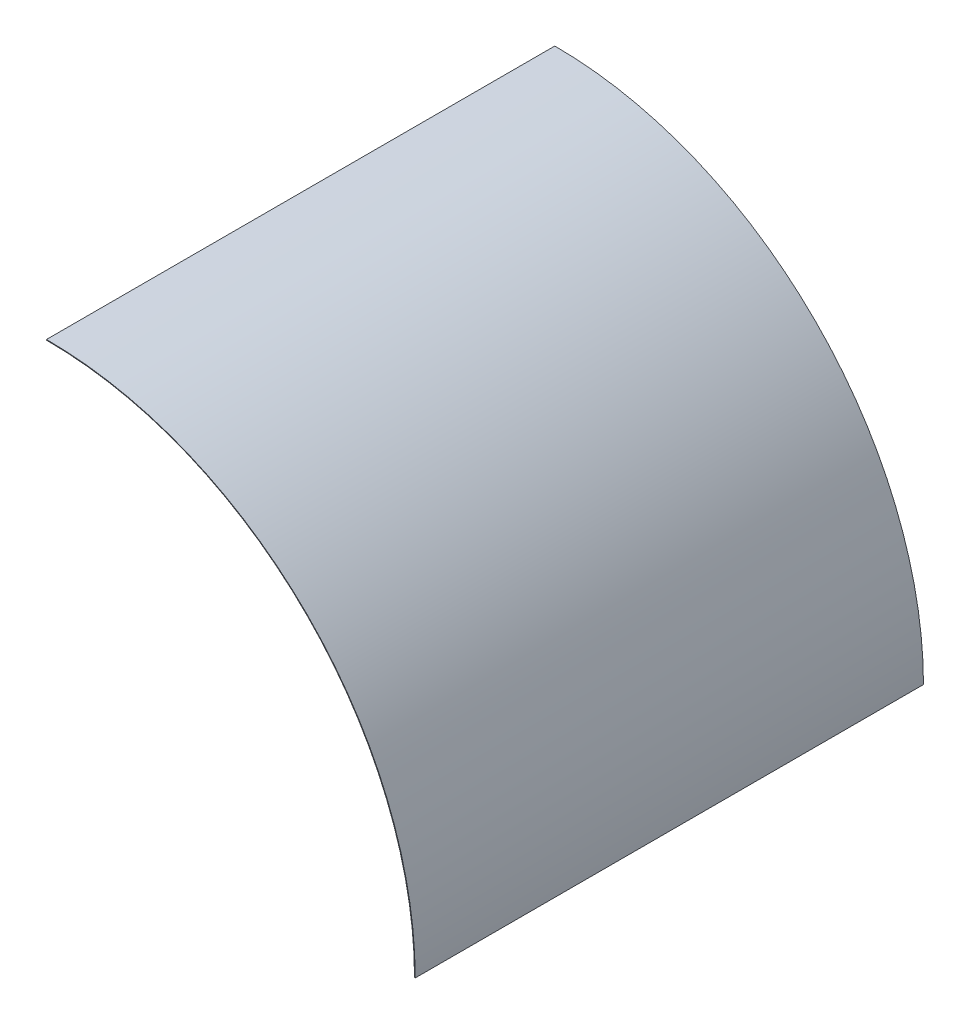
ISO-10303-21;
HEADER;
FILE_DESCRIPTION(('STEP AP214'),'2;1');
FILE_NAME('part.step','',(''),(''),'','','');
FILE_SCHEMA(('AUTOMOTIVE_DESIGN { 1 0 10303 214 1 1 1 1 }'));
ENDSEC;
DATA;
#1=APPLICATION_CONTEXT('core data for automotive mechanical design processes');
#2=APPLICATION_PROTOCOL_DEFINITION('international standard','automotive_design',2000,#1);
#3=PRODUCT_CONTEXT('',#1,'mechanical');
#4=PRODUCT('Part','Part','',(#3));
#5=PRODUCT_RELATED_PRODUCT_CATEGORY('part','',(#4));
#6=PRODUCT_DEFINITION_FORMATION('','',#4);
#7=PRODUCT_DEFINITION_CONTEXT('part definition',#1,'design');
#8=PRODUCT_DEFINITION('design','',#6,#7);
#9=PRODUCT_DEFINITION_SHAPE('','',#8);
#10=(LENGTH_UNIT() NAMED_UNIT(*) SI_UNIT(.MILLI.,.METRE.));
#11=(NAMED_UNIT(*) PLANE_ANGLE_UNIT() SI_UNIT($,.RADIAN.));
#12=(NAMED_UNIT(*) SI_UNIT($,.STERADIAN.) SOLID_ANGLE_UNIT());
#13=UNCERTAINTY_MEASURE_WITH_UNIT(LENGTH_MEASURE(1.E-05),#10,'distance_accuracy_value','');
#14=(GEOMETRIC_REPRESENTATION_CONTEXT(3) GLOBAL_UNCERTAINTY_ASSIGNED_CONTEXT((#13)) GLOBAL_UNIT_ASSIGNED_CONTEXT((#10,
#11,#12)) REPRESENTATION_CONTEXT('',''));
#15=CARTESIAN_POINT('',(0.,0.,0.));
#16=DIRECTION('',(0.,0.,1.));
#17=DIRECTION('',(1.,0.,0.));
#18=AXIS2_PLACEMENT_3D('',#15,#16,#17);
#19=CARTESIAN_POINT('',(0.,0.,-3000.));
#20=DIRECTION('',(0.,0.,1.));
#21=DIRECTION('',(1.,0.,0.));
#22=AXIS2_PLACEMENT_3D('',#19,#20,#21);
#23=CYLINDRICAL_SURFACE('',#22,2172.);
#24=CARTESIAN_POINT('',(0.,0.,0.));
#25=DIRECTION('',(0.,0.,-1.));
#26=DIRECTION('',(-1.,0.,0.));
#27=AXIS2_PLACEMENT_3D('',#24,#25,#26);
#28=CIRCLE('',#27,2172.);
#29=CARTESIAN_POINT('',(0.,2172.,0.));
#30=VERTEX_POINT('',#29);
#31=CARTESIAN_POINT('',(2172.,0.,0.));
#32=VERTEX_POINT('',#31);
#33=EDGE_CURVE('E100',#30,#32,#28,.T.);
#34=ORIENTED_EDGE('',*,*,#33,.F.);
#35=DIRECTION('',(0.,0.,1.));
#36=VECTOR('',#35,1.);
#37=CARTESIAN_POINT('',(0.,2172.,-3000.));
#38=LINE('',#37,#36);
#39=CARTESIAN_POINT('',(0.,2172.,-3000.));
#40=VERTEX_POINT('',#39);
#41=EDGE_CURVE('E11',#40,#30,#38,.T.);
#42=ORIENTED_EDGE('',*,*,#41,.F.);
#43=CARTESIAN_POINT('',(0.,0.,-3000.));
#44=DIRECTION('',(0.,0.,-1.));
#45=DIRECTION('',(-1.,0.,0.));
#46=AXIS2_PLACEMENT_3D('',#43,#44,#45);
#47=CIRCLE('',#46,2172.);
#48=CARTESIAN_POINT('',(2172.,0.,-3000.));
#49=VERTEX_POINT('',#48);
#50=EDGE_CURVE('E94',#40,#49,#47,.T.);
#51=ORIENTED_EDGE('',*,*,#50,.T.);
#52=DIRECTION('',(0.,0.,1.));
#53=VECTOR('',#52,1.);
#54=CARTESIAN_POINT('',(2172.,0.,-3000.));
#55=LINE('',#54,#53);
#56=EDGE_CURVE('E39',#49,#32,#55,.T.);
#57=ORIENTED_EDGE('',*,*,#56,.T.);
#58=EDGE_LOOP('',(#34,#42,#51,#57));
#59=FACE_BOUND('',#58,.T.);
#60=ADVANCED_FACE('F36',(#59),#23,.F.);
#61=CARTESIAN_POINT('',(0.,2176.,-3000.));
#62=DIRECTION('',(-1.,0.,0.));
#63=DIRECTION('',(0.,0.,1.));
#64=AXIS2_PLACEMENT_3D('',#61,#62,#63);
#65=PLANE('',#64);
#66=DIRECTION('',(0.,-1.,0.));
#67=VECTOR('',#66,1.);
#68=CARTESIAN_POINT('',(0.,2176.,0.));
#69=LINE('',#68,#67);
#70=CARTESIAN_POINT('',(0.,2176.,0.));
#71=VERTEX_POINT('',#70);
#72=EDGE_CURVE('E96',#71,#30,#69,.T.);
#73=ORIENTED_EDGE('',*,*,#72,.F.);
#74=DIRECTION('',(0.,0.,1.));
#75=VECTOR('',#74,1.);
#76=CARTESIAN_POINT('',(0.,2176.,-3000.));
#77=LINE('',#76,#75);
#78=CARTESIAN_POINT('',(0.,2176.,-3000.));
#79=VERTEX_POINT('',#78);
#80=EDGE_CURVE('E45',#79,#71,#77,.T.);
#81=ORIENTED_EDGE('',*,*,#80,.F.);
#82=DIRECTION('',(0.,-1.,0.));
#83=VECTOR('',#82,1.);
#84=CARTESIAN_POINT('',(0.,2176.,-3000.));
#85=LINE('',#84,#83);
#86=EDGE_CURVE('E91',#79,#40,#85,.T.);
#87=ORIENTED_EDGE('',*,*,#86,.T.);
#88=ORIENTED_EDGE('',*,*,#41,.T.);
#89=EDGE_LOOP('',(#73,#81,#87,#88));
#90=FACE_BOUND('',#89,.T.);
#91=ADVANCED_FACE('F110',(#90),#65,.T.);
#92=CARTESIAN_POINT('',(0.,0.,-3000.));
#93=DIRECTION('',(0.,0.,1.));
#94=DIRECTION('',(1.,0.,0.));
#95=AXIS2_PLACEMENT_3D('',#92,#93,#94);
#96=CYLINDRICAL_SURFACE('',#95,2176.);
#97=CARTESIAN_POINT('',(0.,0.,0.));
#98=DIRECTION('',(0.,0.,1.));
#99=DIRECTION('',(-1.,0.,0.));
#100=AXIS2_PLACEMENT_3D('',#97,#98,#99);
#101=CIRCLE('',#100,2176.);
#102=CARTESIAN_POINT('',(2176.,2.66483143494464E-13,0.));
#103=VERTEX_POINT('',#102);
#104=EDGE_CURVE('E86',#103,#71,#101,.T.);
#105=ORIENTED_EDGE('',*,*,#104,.F.);
#106=DIRECTION('',(0.,0.,1.));
#107=VECTOR('',#106,1.);
#108=CARTESIAN_POINT('',(2176.,2.66483143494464E-13,-3000.));
#109=LINE('',#108,#107);
#110=CARTESIAN_POINT('',(2176.,2.66483143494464E-13,-3000.));
#111=VERTEX_POINT('',#110);
#112=EDGE_CURVE('E81',#111,#103,#109,.T.);
#113=ORIENTED_EDGE('',*,*,#112,.F.);
#114=CARTESIAN_POINT('',(0.,0.,-3000.));
#115=DIRECTION('',(0.,0.,1.));
#116=DIRECTION('',(-1.,0.,0.));
#117=AXIS2_PLACEMENT_3D('',#114,#115,#116);
#118=CIRCLE('',#117,2176.);
#119=EDGE_CURVE('E84',#111,#79,#118,.T.);
#120=ORIENTED_EDGE('',*,*,#119,.T.);
#121=ORIENTED_EDGE('',*,*,#80,.T.);
#122=EDGE_LOOP('',(#105,#113,#120,#121));
#123=FACE_BOUND('',#122,.T.);
#124=ADVANCED_FACE('F83',(#123),#96,.T.);
#125=CARTESIAN_POINT('',(2176.,0.,-3000.));
#126=DIRECTION('',(0.,-1.,0.));
#127=DIRECTION('',(0.,0.,-1.));
#128=AXIS2_PLACEMENT_3D('',#125,#126,#127);
#129=PLANE('',#128);
#130=DIRECTION('',(1.,0.,0.));
#131=VECTOR('',#130,1.);
#132=CARTESIAN_POINT('',(2176.,0.,0.));
#133=LINE('',#132,#131);
#134=EDGE_CURVE('E103',#32,#103,#133,.T.);
#135=ORIENTED_EDGE('',*,*,#134,.F.);
#136=ORIENTED_EDGE('',*,*,#56,.F.);
#137=DIRECTION('',(1.,0.,0.));
#138=VECTOR('',#137,1.);
#139=CARTESIAN_POINT('',(2176.,0.,-3000.));
#140=LINE('',#139,#138);
#141=EDGE_CURVE('E90',#49,#111,#140,.T.);
#142=ORIENTED_EDGE('',*,*,#141,.T.);
#143=ORIENTED_EDGE('',*,*,#112,.T.);
#144=EDGE_LOOP('',(#135,#136,#142,#143));
#145=FACE_BOUND('',#144,.T.);
#146=ADVANCED_FACE('F93',(#145),#129,.T.);
#147=CARTESIAN_POINT('',(0.,0.,-3000.));
#148=DIRECTION('',(0.,0.,-1.));
#149=DIRECTION('',(-1.,0.,0.));
#150=AXIS2_PLACEMENT_3D('',#147,#148,#149);
#151=PLANE('',#150);
#152=ORIENTED_EDGE('',*,*,#50,.F.);
#153=ORIENTED_EDGE('',*,*,#86,.F.);
#154=ORIENTED_EDGE('',*,*,#119,.F.);
#155=ORIENTED_EDGE('',*,*,#141,.F.);
#156=EDGE_LOOP('',(#152,#153,#154,#155));
#157=FACE_BOUND('',#156,.T.);
#158=ADVANCED_FACE('F89',(#157),#151,.T.);
#159=CARTESIAN_POINT('',(0.,0.,0.));
#160=DIRECTION('',(0.,0.,-1.));
#161=DIRECTION('',(-1.,0.,0.));
#162=AXIS2_PLACEMENT_3D('',#159,#160,#161);
#163=PLANE('',#162);
#164=ORIENTED_EDGE('',*,*,#33,.T.);
#165=ORIENTED_EDGE('',*,*,#134,.T.);
#166=ORIENTED_EDGE('',*,*,#104,.T.);
#167=ORIENTED_EDGE('',*,*,#72,.T.);
#168=EDGE_LOOP('',(#164,#165,#166,#167));
#169=FACE_BOUND('',#168,.T.);
#170=ADVANCED_FACE('F109',(#169),#163,.F.);
#171=CLOSED_SHELL('',(#60,#91,#124,#146,#158,#170));
#172=MANIFOLD_SOLID_BREP('B2',#171);
#173=ADVANCED_BREP_SHAPE_REPRESENTATION('',(#18,#172),#14);
#174=SHAPE_DEFINITION_REPRESENTATION(#9,#173);
ENDSEC;
END-ISO-10303-21;
